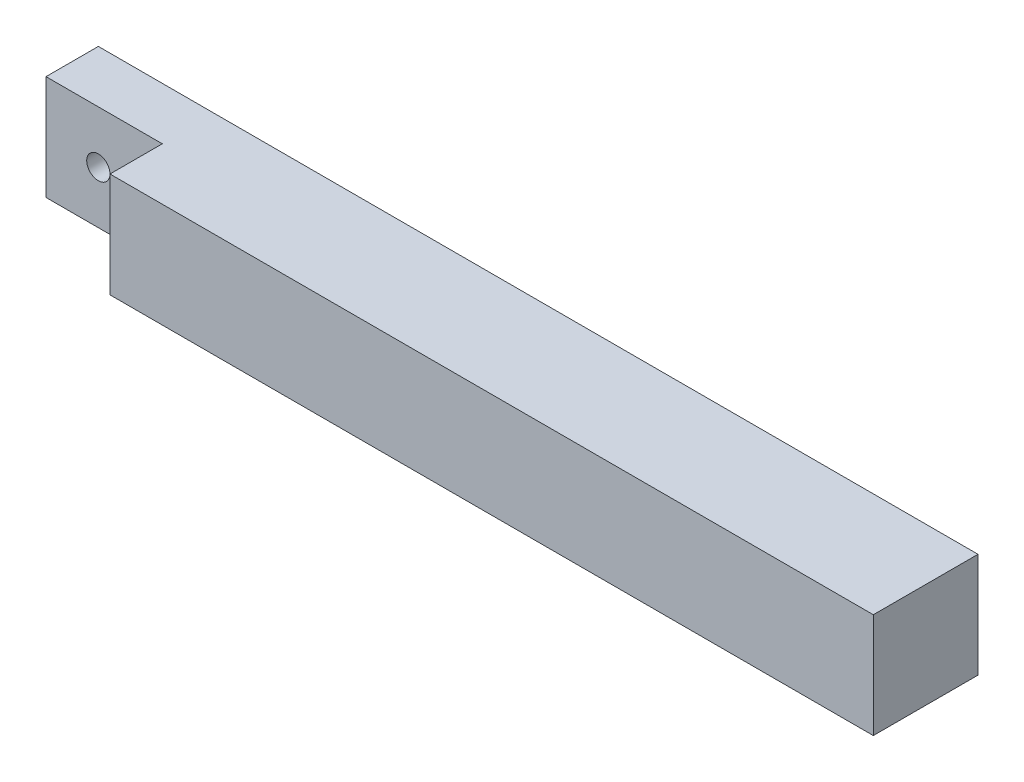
ISO-10303-21;
HEADER;
FILE_DESCRIPTION(('STEP AP214'),'2;1');
FILE_NAME('part.step','',(''),(''),'','','');
FILE_SCHEMA(('AUTOMOTIVE_DESIGN { 1 0 10303 214 1 1 1 1 }'));
ENDSEC;
DATA;
#1=APPLICATION_CONTEXT('core data for automotive mechanical design processes');
#2=APPLICATION_PROTOCOL_DEFINITION('international standard','automotive_design',2000,#1);
#3=PRODUCT_CONTEXT('',#1,'mechanical');
#4=PRODUCT('Part','Part','',(#3));
#5=PRODUCT_RELATED_PRODUCT_CATEGORY('part','',(#4));
#6=PRODUCT_DEFINITION_FORMATION('','',#4);
#7=PRODUCT_DEFINITION_CONTEXT('part definition',#1,'design');
#8=PRODUCT_DEFINITION('design','',#6,#7);
#9=PRODUCT_DEFINITION_SHAPE('','',#8);
#10=(LENGTH_UNIT() NAMED_UNIT(*) SI_UNIT(.MILLI.,.METRE.));
#11=(NAMED_UNIT(*) PLANE_ANGLE_UNIT() SI_UNIT($,.RADIAN.));
#12=(NAMED_UNIT(*) SI_UNIT($,.STERADIAN.) SOLID_ANGLE_UNIT());
#13=UNCERTAINTY_MEASURE_WITH_UNIT(LENGTH_MEASURE(1.E-05),#10,'distance_accuracy_value','');
#14=(GEOMETRIC_REPRESENTATION_CONTEXT(3) GLOBAL_UNCERTAINTY_ASSIGNED_CONTEXT((#13)) GLOBAL_UNIT_ASSIGNED_CONTEXT((#10,
#11,#12)) REPRESENTATION_CONTEXT('',''));
#15=CARTESIAN_POINT('',(0.,0.,0.));
#16=DIRECTION('',(0.,0.,1.));
#17=DIRECTION('',(1.,0.,0.));
#18=AXIS2_PLACEMENT_3D('',#15,#16,#17);
#19=CARTESIAN_POINT('',(0.,0.,9.));
#20=DIRECTION('',(1.,0.,0.));
#21=DIRECTION('',(0.,0.,-1.));
#22=AXIS2_PLACEMENT_3D('',#19,#20,#21);
#23=PLANE('',#22);
#24=DIRECTION('',(0.,-1.,0.));
#25=VECTOR('',#24,1.);
#26=CARTESIAN_POINT('',(0.,9.,4.5));
#27=LINE('',#26,#25);
#28=CARTESIAN_POINT('',(0.,9.,4.5));
#29=VERTEX_POINT('',#28);
#30=CARTESIAN_POINT('',(0.,0.,4.5));
#31=VERTEX_POINT('',#30);
#32=EDGE_CURVE('E79',#29,#31,#27,.T.);
#33=ORIENTED_EDGE('',*,*,#32,.F.);
#34=DIRECTION('',(0.,0.,-1.));
#35=VECTOR('',#34,1.);
#36=CARTESIAN_POINT('',(0.,9.,9.));
#37=LINE('',#36,#35);
#38=CARTESIAN_POINT('',(0.,9.,0.));
#39=VERTEX_POINT('',#38);
#40=EDGE_CURVE('E73',#29,#39,#37,.T.);
#41=ORIENTED_EDGE('',*,*,#40,.T.);
#42=DIRECTION('',(0.,-1.,0.));
#43=VECTOR('',#42,1.);
#44=CARTESIAN_POINT('',(0.,0.,0.));
#45=LINE('',#44,#43);
#46=CARTESIAN_POINT('',(0.,0.,0.));
#47=VERTEX_POINT('',#46);
#48=EDGE_CURVE('E77',#39,#47,#45,.T.);
#49=ORIENTED_EDGE('',*,*,#48,.T.);
#50=DIRECTION('',(0.,0.,-1.));
#51=VECTOR('',#50,1.);
#52=CARTESIAN_POINT('',(0.,0.,9.));
#53=LINE('',#52,#51);
#54=EDGE_CURVE('E11',#31,#47,#53,.T.);
#55=ORIENTED_EDGE('',*,*,#54,.F.);
#56=EDGE_LOOP('',(#33,#41,#49,#55));
#57=FACE_BOUND('',#56,.T.);
#58=ADVANCED_FACE('F31',(#57),#23,.F.);
#59=CARTESIAN_POINT('',(0.,0.,9.));
#60=DIRECTION('',(0.,1.,0.));
#61=DIRECTION('',(0.,0.,1.));
#62=AXIS2_PLACEMENT_3D('',#59,#60,#61);
#63=PLANE('',#62);
#64=DIRECTION('',(1.,0.,0.));
#65=VECTOR('',#64,1.);
#66=CARTESIAN_POINT('',(0.,0.,9.));
#67=LINE('',#66,#65);
#68=CARTESIAN_POINT('',(10.,0.,9.));
#69=VERTEX_POINT('',#68);
#70=CARTESIAN_POINT('',(75.63,0.,9.));
#71=VERTEX_POINT('',#70);
#72=EDGE_CURVE('E92',#69,#71,#67,.T.);
#73=ORIENTED_EDGE('',*,*,#72,.F.);
#74=DIRECTION('',(0.,0.,1.));
#75=VECTOR('',#74,1.);
#76=CARTESIAN_POINT('',(10.,0.,4.5));
#77=LINE('',#76,#75);
#78=CARTESIAN_POINT('',(10.,0.,4.5));
#79=VERTEX_POINT('',#78);
#80=EDGE_CURVE('E45',#79,#69,#77,.T.);
#81=ORIENTED_EDGE('',*,*,#80,.F.);
#82=DIRECTION('',(1.,0.,0.));
#83=VECTOR('',#82,1.);
#84=CARTESIAN_POINT('',(0.,0.,4.5));
#85=LINE('',#84,#83);
#86=EDGE_CURVE('E117',#31,#79,#85,.T.);
#87=ORIENTED_EDGE('',*,*,#86,.F.);
#88=ORIENTED_EDGE('',*,*,#54,.T.);
#89=DIRECTION('',(1.,0.,0.));
#90=VECTOR('',#89,1.);
#91=CARTESIAN_POINT('',(0.,0.,0.));
#92=LINE('',#91,#90);
#93=CARTESIAN_POINT('',(75.63,0.,0.));
#94=VERTEX_POINT('',#93);
#95=EDGE_CURVE('E97',#47,#94,#92,.T.);
#96=ORIENTED_EDGE('',*,*,#95,.T.);
#97=DIRECTION('',(0.,0.,-1.));
#98=VECTOR('',#97,1.);
#99=CARTESIAN_POINT('',(75.63,0.,9.));
#100=LINE('',#99,#98);
#101=EDGE_CURVE('E38',#71,#94,#100,.T.);
#102=ORIENTED_EDGE('',*,*,#101,.F.);
#103=EDGE_LOOP('',(#73,#81,#87,#88,#96,#102));
#104=FACE_BOUND('',#103,.T.);
#105=ADVANCED_FACE('F113',(#104),#63,.F.);
#106=CARTESIAN_POINT('',(75.63,0.,9.));
#107=DIRECTION('',(-1.,0.,0.));
#108=DIRECTION('',(0.,0.,1.));
#109=AXIS2_PLACEMENT_3D('',#106,#107,#108);
#110=PLANE('',#109);
#111=DIRECTION('',(0.,1.,0.));
#112=VECTOR('',#111,1.);
#113=CARTESIAN_POINT('',(75.63,0.,0.));
#114=LINE('',#113,#112);
#115=CARTESIAN_POINT('',(75.63,9.,0.));
#116=VERTEX_POINT('',#115);
#117=EDGE_CURVE('E93',#94,#116,#114,.T.);
#118=ORIENTED_EDGE('',*,*,#117,.T.);
#119=DIRECTION('',(0.,0.,-1.));
#120=VECTOR('',#119,1.);
#121=CARTESIAN_POINT('',(75.63,9.,9.));
#122=LINE('',#121,#120);
#123=CARTESIAN_POINT('',(75.63,9.,9.));
#124=VERTEX_POINT('',#123);
#125=EDGE_CURVE('E82',#124,#116,#122,.T.);
#126=ORIENTED_EDGE('',*,*,#125,.F.);
#127=DIRECTION('',(0.,1.,0.));
#128=VECTOR('',#127,1.);
#129=CARTESIAN_POINT('',(75.63,0.,9.));
#130=LINE('',#129,#128);
#131=EDGE_CURVE('E54',#71,#124,#130,.T.);
#132=ORIENTED_EDGE('',*,*,#131,.F.);
#133=ORIENTED_EDGE('',*,*,#101,.T.);
#134=EDGE_LOOP('',(#118,#126,#132,#133));
#135=FACE_BOUND('',#134,.T.);
#136=ADVANCED_FACE('F110',(#135),#110,.F.);
#137=CARTESIAN_POINT('',(0.,9.,9.));
#138=DIRECTION('',(0.,-1.,0.));
#139=DIRECTION('',(0.,0.,-1.));
#140=AXIS2_PLACEMENT_3D('',#137,#138,#139);
#141=PLANE('',#140);
#142=DIRECTION('',(-1.,0.,0.));
#143=VECTOR('',#142,1.);
#144=CARTESIAN_POINT('',(0.,9.,4.5));
#145=LINE('',#144,#143);
#146=CARTESIAN_POINT('',(10.,9.,4.5));
#147=VERTEX_POINT('',#146);
#148=EDGE_CURVE('E129',#147,#29,#145,.T.);
#149=ORIENTED_EDGE('',*,*,#148,.F.);
#150=DIRECTION('',(0.,0.,1.));
#151=VECTOR('',#150,1.);
#152=CARTESIAN_POINT('',(10.,9.,4.5));
#153=LINE('',#152,#151);
#154=CARTESIAN_POINT('',(10.,9.,9.));
#155=VERTEX_POINT('',#154);
#156=EDGE_CURVE('E98',#147,#155,#153,.T.);
#157=ORIENTED_EDGE('',*,*,#156,.T.);
#158=DIRECTION('',(-1.,0.,0.));
#159=VECTOR('',#158,1.);
#160=CARTESIAN_POINT('',(0.,9.,9.));
#161=LINE('',#160,#159);
#162=EDGE_CURVE('E83',#124,#155,#161,.T.);
#163=ORIENTED_EDGE('',*,*,#162,.F.);
#164=ORIENTED_EDGE('',*,*,#125,.T.);
#165=DIRECTION('',(-1.,0.,0.));
#166=VECTOR('',#165,1.);
#167=CARTESIAN_POINT('',(0.,9.,0.));
#168=LINE('',#167,#166);
#169=EDGE_CURVE('E87',#116,#39,#168,.T.);
#170=ORIENTED_EDGE('',*,*,#169,.T.);
#171=ORIENTED_EDGE('',*,*,#40,.F.);
#172=EDGE_LOOP('',(#149,#157,#163,#164,#170,#171));
#173=FACE_BOUND('',#172,.T.);
#174=ADVANCED_FACE('F88',(#173),#141,.F.);
#175=CARTESIAN_POINT('',(0.,9.,9.));
#176=DIRECTION('',(0.,0.,-1.));
#177=DIRECTION('',(-1.,0.,0.));
#178=AXIS2_PLACEMENT_3D('',#175,#176,#177);
#179=PLANE('',#178);
#180=ORIENTED_EDGE('',*,*,#162,.T.);
#181=DIRECTION('',(0.,1.,0.));
#182=VECTOR('',#181,1.);
#183=CARTESIAN_POINT('',(10.,9.,9.));
#184=LINE('',#183,#182);
#185=EDGE_CURVE('E137',#69,#155,#184,.T.);
#186=ORIENTED_EDGE('',*,*,#185,.F.);
#187=ORIENTED_EDGE('',*,*,#72,.T.);
#188=ORIENTED_EDGE('',*,*,#131,.T.);
#189=EDGE_LOOP('',(#180,#186,#187,#188));
#190=FACE_BOUND('',#189,.T.);
#191=ADVANCED_FACE('F140',(#190),#179,.F.);
#192=CARTESIAN_POINT('',(0.,9.,0.));
#193=DIRECTION('',(0.,0.,-1.));
#194=DIRECTION('',(-1.,0.,0.));
#195=AXIS2_PLACEMENT_3D('',#192,#193,#194);
#196=PLANE('',#195);
#197=CARTESIAN_POINT('',(4.5,4.5,0.));
#198=DIRECTION('',(0.,0.,1.));
#199=DIRECTION('',(1.,0.,0.));
#200=AXIS2_PLACEMENT_3D('',#197,#198,#199);
#201=CIRCLE('',#200,1.);
#202=CARTESIAN_POINT('',(5.5,4.5,0.));
#203=VERTEX_POINT('',#202);
#204=EDGE_CURVE('E138',#203,#203,#201,.T.);
#205=ORIENTED_EDGE('',*,*,#204,.T.);
#206=EDGE_LOOP('',(#205));
#207=FACE_BOUND('',#206,.T.);
#208=ORIENTED_EDGE('',*,*,#48,.F.);
#209=ORIENTED_EDGE('',*,*,#169,.F.);
#210=ORIENTED_EDGE('',*,*,#117,.F.);
#211=ORIENTED_EDGE('',*,*,#95,.F.);
#212=EDGE_LOOP('',(#208,#209,#210,#211));
#213=FACE_BOUND('',#212,.T.);
#214=ADVANCED_FACE('F96',(#207,#213),#196,.T.);
#215=CARTESIAN_POINT('',(10.,9.,4.5));
#216=DIRECTION('',(1.,0.,0.));
#217=DIRECTION('',(0.,1.,0.));
#218=AXIS2_PLACEMENT_3D('',#215,#216,#217);
#219=PLANE('',#218);
#220=ORIENTED_EDGE('',*,*,#185,.T.);
#221=ORIENTED_EDGE('',*,*,#156,.F.);
#222=DIRECTION('',(0.,1.,0.));
#223=VECTOR('',#222,1.);
#224=CARTESIAN_POINT('',(10.,9.,4.5));
#225=LINE('',#224,#223);
#226=EDGE_CURVE('E131',#79,#147,#225,.T.);
#227=ORIENTED_EDGE('',*,*,#226,.F.);
#228=ORIENTED_EDGE('',*,*,#80,.T.);
#229=EDGE_LOOP('',(#220,#221,#227,#228));
#230=FACE_BOUND('',#229,.T.);
#231=ADVANCED_FACE('F141',(#230),#219,.F.);
#232=CARTESIAN_POINT('',(0.,0.,4.5));
#233=DIRECTION('',(0.,0.,1.));
#234=DIRECTION('',(1.,0.,0.));
#235=AXIS2_PLACEMENT_3D('',#232,#233,#234);
#236=PLANE('',#235);
#237=CARTESIAN_POINT('',(4.5,4.5,4.5));
#238=DIRECTION('',(0.,0.,1.));
#239=DIRECTION('',(1.,0.,0.));
#240=AXIS2_PLACEMENT_3D('',#237,#238,#239);
#241=CIRCLE('',#240,1.);
#242=CARTESIAN_POINT('',(5.5,4.5,4.5));
#243=VERTEX_POINT('',#242);
#244=EDGE_CURVE('E144',#243,#243,#241,.T.);
#245=ORIENTED_EDGE('',*,*,#244,.F.);
#246=EDGE_LOOP('',(#245));
#247=FACE_BOUND('',#246,.T.);
#248=ORIENTED_EDGE('',*,*,#32,.T.);
#249=ORIENTED_EDGE('',*,*,#86,.T.);
#250=ORIENTED_EDGE('',*,*,#226,.T.);
#251=ORIENTED_EDGE('',*,*,#148,.T.);
#252=EDGE_LOOP('',(#248,#249,#250,#251));
#253=FACE_BOUND('',#252,.T.);
#254=ADVANCED_FACE('F130',(#247,#253),#236,.T.);
#255=CARTESIAN_POINT('',(4.5,4.5,0.));
#256=DIRECTION('',(0.,0.,1.));
#257=DIRECTION('',(1.,0.,0.));
#258=AXIS2_PLACEMENT_3D('',#255,#256,#257);
#259=CYLINDRICAL_SURFACE('',#258,1.);
#260=ORIENTED_EDGE('',*,*,#204,.F.);
#261=EDGE_LOOP('',(#260));
#262=FACE_BOUND('',#261,.T.);
#263=ORIENTED_EDGE('',*,*,#244,.T.);
#264=EDGE_LOOP('',(#263));
#265=FACE_BOUND('',#264,.T.);
#266=ADVANCED_FACE('F151',(#262,#265),#259,.F.);
#267=CLOSED_SHELL('',(#58,#105,#136,#174,#191,#214,#231,#254,#266));
#268=MANIFOLD_SOLID_BREP('B2',#267);
#269=ADVANCED_BREP_SHAPE_REPRESENTATION('',(#18,#268),#14);
#270=SHAPE_DEFINITION_REPRESENTATION(#9,#269);
ENDSEC;
END-ISO-10303-21;
